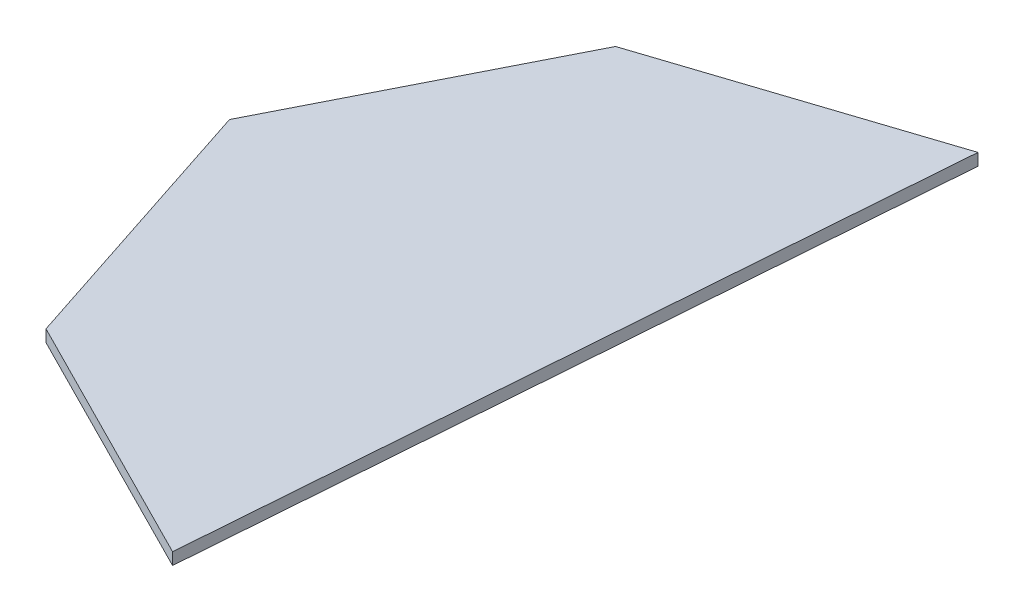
ISO-10303-21;
HEADER;
FILE_DESCRIPTION(('STEP AP214'),'2;1');
FILE_NAME('part.step','',(''),(''),'','','');
FILE_SCHEMA(('AUTOMOTIVE_DESIGN { 1 0 10303 214 1 1 1 1 }'));
ENDSEC;
DATA;
#1=APPLICATION_CONTEXT('core data for automotive mechanical design processes');
#2=APPLICATION_PROTOCOL_DEFINITION('international standard','automotive_design',2000,#1);
#3=PRODUCT_CONTEXT('',#1,'mechanical');
#4=PRODUCT('Part','Part','',(#3));
#5=PRODUCT_RELATED_PRODUCT_CATEGORY('part','',(#4));
#6=PRODUCT_DEFINITION_FORMATION('','',#4);
#7=PRODUCT_DEFINITION_CONTEXT('part definition',#1,'design');
#8=PRODUCT_DEFINITION('design','',#6,#7);
#9=PRODUCT_DEFINITION_SHAPE('','',#8);
#10=(LENGTH_UNIT() NAMED_UNIT(*) SI_UNIT(.MILLI.,.METRE.));
#11=(NAMED_UNIT(*) PLANE_ANGLE_UNIT() SI_UNIT($,.RADIAN.));
#12=(NAMED_UNIT(*) SI_UNIT($,.STERADIAN.) SOLID_ANGLE_UNIT());
#13=UNCERTAINTY_MEASURE_WITH_UNIT(LENGTH_MEASURE(1.E-05),#10,'distance_accuracy_value','');
#14=(GEOMETRIC_REPRESENTATION_CONTEXT(3) GLOBAL_UNCERTAINTY_ASSIGNED_CONTEXT((#13)) GLOBAL_UNIT_ASSIGNED_CONTEXT((#10,
#11,#12)) REPRESENTATION_CONTEXT('',''));
#15=CARTESIAN_POINT('',(0.,0.,0.));
#16=DIRECTION('',(0.,0.,1.));
#17=DIRECTION('',(1.,0.,0.));
#18=AXIS2_PLACEMENT_3D('',#15,#16,#17);
#19=CARTESIAN_POINT('',(-245.002352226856,12.,-285.327733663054));
#20=DIRECTION('',(0.892205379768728,0.,0.451629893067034));
#21=DIRECTION('',(0.451629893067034,0.,-0.892205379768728));
#22=AXIS2_PLACEMENT_3D('',#19,#20,#21);
#23=PLANE('',#22);
#24=DIRECTION('',(-0.451629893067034,0.,0.892205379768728));
#25=VECTOR('',#24,1.);
#26=CARTESIAN_POINT('',(-245.002352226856,0.,-285.327733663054));
#27=LINE('',#26,#25);
#28=CARTESIAN_POINT('',(-245.002352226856,0.,-285.327733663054));
#29=VERTEX_POINT('',#28);
#30=CARTESIAN_POINT('',(-375.,0.,-28.5143506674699));
#31=VERTEX_POINT('',#30);
#32=EDGE_CURVE('E106',#29,#31,#27,.T.);
#33=ORIENTED_EDGE('',*,*,#32,.T.);
#34=DIRECTION('',(0.,-1.,0.));
#35=VECTOR('',#34,1.);
#36=CARTESIAN_POINT('',(-375.,12.,-28.5143506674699));
#37=LINE('',#36,#35);
#38=CARTESIAN_POINT('',(-375.,12.,-28.5143506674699));
#39=VERTEX_POINT('',#38);
#40=EDGE_CURVE('E11',#39,#31,#37,.T.);
#41=ORIENTED_EDGE('',*,*,#40,.F.);
#42=DIRECTION('',(-0.451629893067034,0.,0.892205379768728));
#43=VECTOR('',#42,1.);
#44=CARTESIAN_POINT('',(-245.002352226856,12.,-285.327733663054));
#45=LINE('',#44,#43);
#46=CARTESIAN_POINT('',(-245.002352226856,12.,-285.327733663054));
#47=VERTEX_POINT('',#46);
#48=EDGE_CURVE('E115',#47,#39,#45,.T.);
#49=ORIENTED_EDGE('',*,*,#48,.F.);
#50=DIRECTION('',(0.,-1.,0.));
#51=VECTOR('',#50,1.);
#52=CARTESIAN_POINT('',(-245.002352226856,12.,-285.327733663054));
#53=LINE('',#52,#51);
#54=EDGE_CURVE('E102',#47,#29,#53,.T.);
#55=ORIENTED_EDGE('',*,*,#54,.T.);
#56=EDGE_LOOP('',(#33,#41,#49,#55));
#57=FACE_BOUND('',#56,.T.);
#58=ADVANCED_FACE('F33',(#57),#23,.F.);
#59=CARTESIAN_POINT('',(-375.,12.,-28.5143506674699));
#60=DIRECTION('',(0.950235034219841,0.,-0.311533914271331));
#61=DIRECTION('',(-0.311533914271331,0.,-0.950235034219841));
#62=AXIS2_PLACEMENT_3D('',#59,#60,#61);
#63=PLANE('',#62);
#64=DIRECTION('',(0.311533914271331,0.,0.950235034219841));
#65=VECTOR('',#64,1.);
#66=CARTESIAN_POINT('',(-375.,0.,-28.5143506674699));
#67=LINE('',#66,#65);
#68=CARTESIAN_POINT('',(-285.327733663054,0.,245.002352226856));
#69=VERTEX_POINT('',#68);
#70=EDGE_CURVE('E109',#31,#69,#67,.T.);
#71=ORIENTED_EDGE('',*,*,#70,.T.);
#72=DIRECTION('',(0.,-1.,0.));
#73=VECTOR('',#72,1.);
#74=CARTESIAN_POINT('',(-285.327733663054,12.,245.002352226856));
#75=LINE('',#74,#73);
#76=CARTESIAN_POINT('',(-285.327733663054,12.,245.002352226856));
#77=VERTEX_POINT('',#76);
#78=EDGE_CURVE('E41',#77,#69,#75,.T.);
#79=ORIENTED_EDGE('',*,*,#78,.F.);
#80=DIRECTION('',(0.311533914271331,0.,0.950235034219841));
#81=VECTOR('',#80,1.);
#82=CARTESIAN_POINT('',(-375.,12.,-28.5143506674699));
#83=LINE('',#82,#81);
#84=EDGE_CURVE('E79',#39,#77,#83,.T.);
#85=ORIENTED_EDGE('',*,*,#84,.F.);
#86=ORIENTED_EDGE('',*,*,#40,.T.);
#87=EDGE_LOOP('',(#71,#79,#85,#86));
#88=FACE_BOUND('',#87,.T.);
#89=ADVANCED_FACE('F134',(#88),#63,.F.);
#90=CARTESIAN_POINT('',(-285.327733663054,12.,245.002352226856));
#91=DIRECTION('',(0.451629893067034,0.,-0.892205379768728));
#92=DIRECTION('',(-0.892205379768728,0.,-0.451629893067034));
#93=AXIS2_PLACEMENT_3D('',#90,#91,#92);
#94=PLANE('',#93);
#95=DIRECTION('',(0.892205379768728,0.,0.451629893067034));
#96=VECTOR('',#95,1.);
#97=CARTESIAN_POINT('',(-285.327733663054,0.,245.002352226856));
#98=LINE('',#97,#96);
#99=CARTESIAN_POINT('',(-28.5143506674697,0.,375.));
#100=VERTEX_POINT('',#99);
#101=EDGE_CURVE('E95',#69,#100,#98,.T.);
#102=ORIENTED_EDGE('',*,*,#101,.T.);
#103=DIRECTION('',(0.,-1.,0.));
#104=VECTOR('',#103,1.);
#105=CARTESIAN_POINT('',(-28.5143506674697,12.,375.));
#106=LINE('',#105,#104);
#107=CARTESIAN_POINT('',(-28.5143506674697,12.,375.));
#108=VERTEX_POINT('',#107);
#109=EDGE_CURVE('E92',#108,#100,#106,.T.);
#110=ORIENTED_EDGE('',*,*,#109,.F.);
#111=DIRECTION('',(0.892205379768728,0.,0.451629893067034));
#112=VECTOR('',#111,1.);
#113=CARTESIAN_POINT('',(-285.327733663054,12.,245.002352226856));
#114=LINE('',#113,#112);
#115=EDGE_CURVE('E83',#77,#108,#114,.T.);
#116=ORIENTED_EDGE('',*,*,#115,.F.);
#117=ORIENTED_EDGE('',*,*,#78,.T.);
#118=EDGE_LOOP('',(#102,#110,#116,#117));
#119=FACE_BOUND('',#118,.T.);
#120=ADVANCED_FACE('F93',(#119),#94,.F.);
#121=CARTESIAN_POINT('',(28.5143506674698,12.,-375.));
#122=DIRECTION('',(0.997121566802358,0.,0.0758193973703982));
#123=DIRECTION('',(0.0758193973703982,0.,-0.997121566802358));
#124=AXIS2_PLACEMENT_3D('',#121,#122,#123);
#125=PLANE('',#124);
#126=DIRECTION('',(-0.0758193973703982,0.,0.997121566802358));
#127=VECTOR('',#126,1.);
#128=CARTESIAN_POINT('',(28.5143506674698,0.,-375.));
#129=LINE('',#128,#127);
#130=CARTESIAN_POINT('',(28.5143506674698,0.,-375.));
#131=VERTEX_POINT('',#130);
#132=EDGE_CURVE('E112',#131,#100,#129,.T.);
#133=ORIENTED_EDGE('',*,*,#132,.F.);
#134=DIRECTION('',(0.,-1.,0.));
#135=VECTOR('',#134,1.);
#136=CARTESIAN_POINT('',(28.5143506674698,12.,-375.));
#137=LINE('',#136,#135);
#138=CARTESIAN_POINT('',(28.5143506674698,12.,-375.));
#139=VERTEX_POINT('',#138);
#140=EDGE_CURVE('E68',#139,#131,#137,.T.);
#141=ORIENTED_EDGE('',*,*,#140,.F.);
#142=DIRECTION('',(-0.0758193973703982,0.,0.997121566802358));
#143=VECTOR('',#142,1.);
#144=CARTESIAN_POINT('',(28.5143506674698,12.,-375.));
#145=LINE('',#144,#143);
#146=EDGE_CURVE('E87',#139,#108,#145,.T.);
#147=ORIENTED_EDGE('',*,*,#146,.T.);
#148=ORIENTED_EDGE('',*,*,#109,.T.);
#149=EDGE_LOOP('',(#133,#141,#147,#148));
#150=FACE_BOUND('',#149,.T.);
#151=ADVANCED_FACE('F100',(#150),#125,.T.);
#152=CARTESIAN_POINT('',(28.5143506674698,12.,-375.));
#153=DIRECTION('',(0.311533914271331,0.,0.950235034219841));
#154=DIRECTION('',(0.950235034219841,0.,-0.311533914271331));
#155=AXIS2_PLACEMENT_3D('',#152,#153,#154);
#156=PLANE('',#155);
#157=DIRECTION('',(-0.950235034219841,0.,0.311533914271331));
#158=VECTOR('',#157,1.);
#159=CARTESIAN_POINT('',(28.5143506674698,0.,-375.));
#160=LINE('',#159,#158);
#161=EDGE_CURVE('E71',#131,#29,#160,.T.);
#162=ORIENTED_EDGE('',*,*,#161,.T.);
#163=ORIENTED_EDGE('',*,*,#54,.F.);
#164=DIRECTION('',(-0.950235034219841,0.,0.311533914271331));
#165=VECTOR('',#164,1.);
#166=CARTESIAN_POINT('',(28.5143506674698,12.,-375.));
#167=LINE('',#166,#165);
#168=EDGE_CURVE('E49',#139,#47,#167,.T.);
#169=ORIENTED_EDGE('',*,*,#168,.F.);
#170=ORIENTED_EDGE('',*,*,#140,.T.);
#171=EDGE_LOOP('',(#162,#163,#169,#170));
#172=FACE_BOUND('',#171,.T.);
#173=ADVANCED_FACE('F123',(#172),#156,.F.);
#174=CARTESIAN_POINT('',(0.,12.,0.));
#175=DIRECTION('',(0.,1.,0.));
#176=DIRECTION('',(0.,0.,1.));
#177=AXIS2_PLACEMENT_3D('',#174,#175,#176);
#178=PLANE('',#177);
#179=ORIENTED_EDGE('',*,*,#48,.T.);
#180=ORIENTED_EDGE('',*,*,#84,.T.);
#181=ORIENTED_EDGE('',*,*,#115,.T.);
#182=ORIENTED_EDGE('',*,*,#146,.F.);
#183=ORIENTED_EDGE('',*,*,#168,.T.);
#184=EDGE_LOOP('',(#179,#180,#181,#182,#183));
#185=FACE_BOUND('',#184,.T.);
#186=ADVANCED_FACE('F85',(#185),#178,.T.);
#187=CARTESIAN_POINT('',(0.,0.,0.));
#188=DIRECTION('',(0.,1.,0.));
#189=DIRECTION('',(0.,0.,1.));
#190=AXIS2_PLACEMENT_3D('',#187,#188,#189);
#191=PLANE('',#190);
#192=ORIENTED_EDGE('',*,*,#32,.F.);
#193=ORIENTED_EDGE('',*,*,#161,.F.);
#194=ORIENTED_EDGE('',*,*,#132,.T.);
#195=ORIENTED_EDGE('',*,*,#101,.F.);
#196=ORIENTED_EDGE('',*,*,#70,.F.);
#197=EDGE_LOOP('',(#192,#193,#194,#195,#196));
#198=FACE_BOUND('',#197,.T.);
#199=ADVANCED_FACE('F119',(#198),#191,.F.);
#200=CLOSED_SHELL('',(#58,#89,#120,#151,#173,#186,#199));
#201=MANIFOLD_SOLID_BREP('B2',#200);
#202=ADVANCED_BREP_SHAPE_REPRESENTATION('',(#18,#201),#14);
#203=SHAPE_DEFINITION_REPRESENTATION(#9,#202);
ENDSEC;
END-ISO-10303-21;
